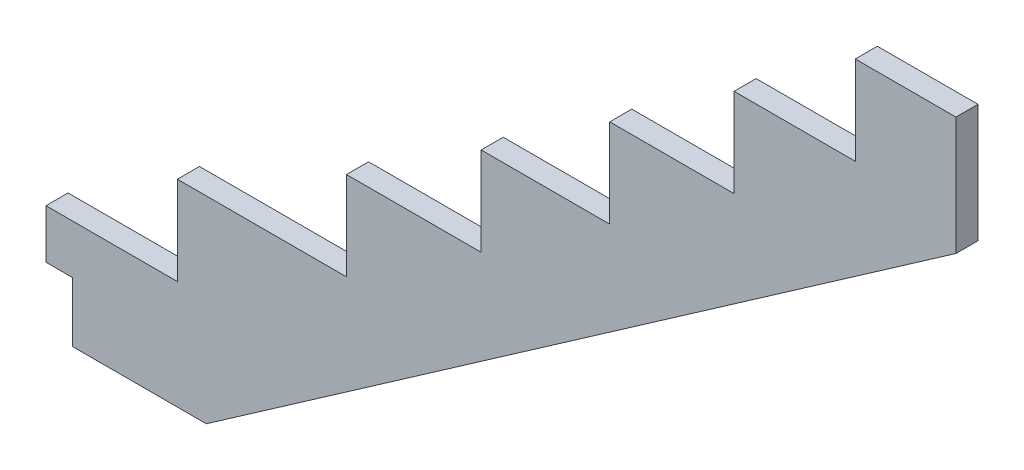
from build123d import *

# Parameters (mm, degrees)
EXTRUDE_1_DEPTH = 50


with BuildPart() as part:
    # Sketch 1 → Extrude 1 (new body)
    with BuildSketch(Plane.XY):
        Polygon((-415.807218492, -623.28309844), (-643.807218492, -623.28309844), (-643.807218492, -824.05309844), (-918.423787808, -824.05309844), (-918.423787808, -1024.82309844), (-1200.138775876, -1024.82309844), (-1200.138775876, -1225.59309844), (-1491.420179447, -1225.59309844), (-1491.420179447, -1426.36309844), (-1796.514212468, -1426.36309844), (-1796.514212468, -1627.13309844), (-2179.636590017, -1627.13309844), (-2179.636590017, -1827.90309844), (-2477.267975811, -1827.90309844), (-2477.267975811, -1938.90309844), (-2417.267975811, -1938.90309844), (-2417.267975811, -2074.234366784), (-2114.166064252, -2074.234366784), (-415.807218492, -891.003911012), align=None)
    extrude(amount=EXTRUDE_1_DEPTH)


solid = part.part
